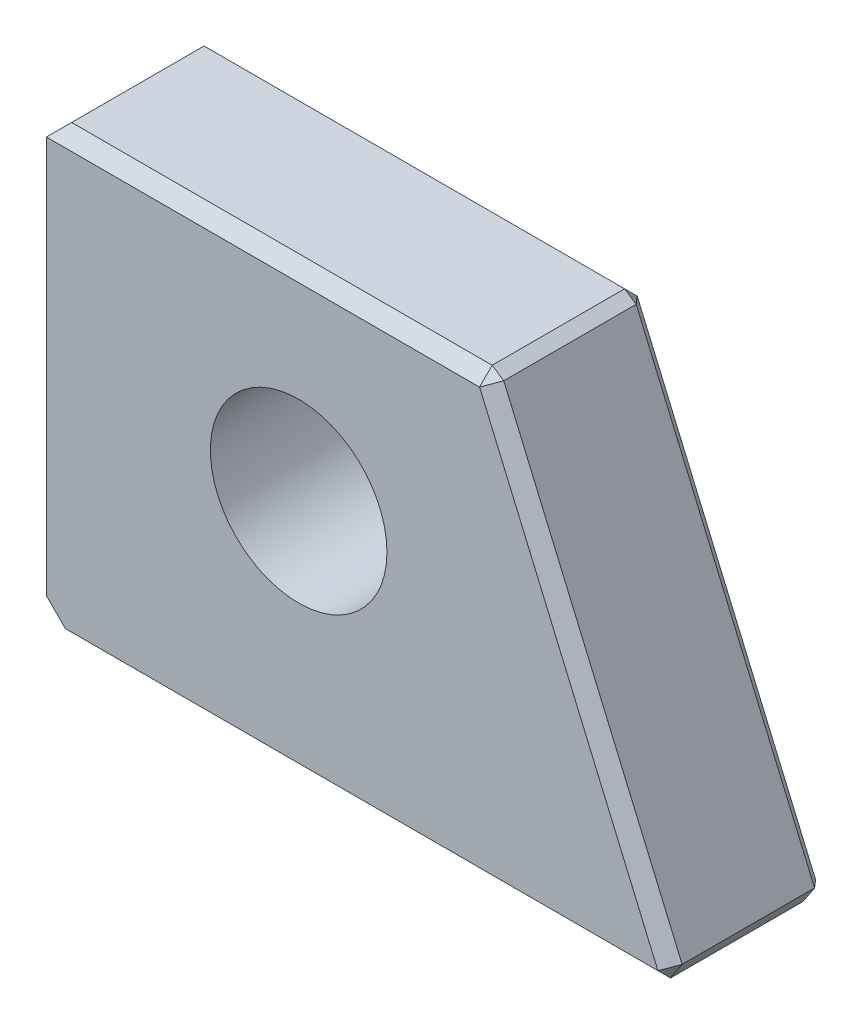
ISO-10303-21;
HEADER;
FILE_DESCRIPTION(('STEP AP214'),'2;1');
FILE_NAME('part.step','',(''),(''),'','','');
FILE_SCHEMA(('AUTOMOTIVE_DESIGN { 1 0 10303 214 1 1 1 1 }'));
ENDSEC;
DATA;
#1=APPLICATION_CONTEXT('core data for automotive mechanical design processes');
#2=APPLICATION_PROTOCOL_DEFINITION('international standard','automotive_design',2000,#1);
#3=PRODUCT_CONTEXT('',#1,'mechanical');
#4=PRODUCT('Part','Part','',(#3));
#5=PRODUCT_RELATED_PRODUCT_CATEGORY('part','',(#4));
#6=PRODUCT_DEFINITION_FORMATION('','',#4);
#7=PRODUCT_DEFINITION_CONTEXT('part definition',#1,'design');
#8=PRODUCT_DEFINITION('design','',#6,#7);
#9=PRODUCT_DEFINITION_SHAPE('','',#8);
#10=(LENGTH_UNIT() NAMED_UNIT(*) SI_UNIT(.MILLI.,.METRE.));
#11=(NAMED_UNIT(*) PLANE_ANGLE_UNIT() SI_UNIT($,.RADIAN.));
#12=(NAMED_UNIT(*) SI_UNIT($,.STERADIAN.) SOLID_ANGLE_UNIT());
#13=UNCERTAINTY_MEASURE_WITH_UNIT(LENGTH_MEASURE(1.E-05),#10,'distance_accuracy_value','');
#14=(GEOMETRIC_REPRESENTATION_CONTEXT(3) GLOBAL_UNCERTAINTY_ASSIGNED_CONTEXT((#13)) GLOBAL_UNIT_ASSIGNED_CONTEXT((#10,
#11,#12)) REPRESENTATION_CONTEXT('',''));
#15=CARTESIAN_POINT('',(0.,0.,0.));
#16=DIRECTION('',(0.,0.,1.));
#17=DIRECTION('',(1.,0.,0.));
#18=AXIS2_PLACEMENT_3D('',#15,#16,#17);
#19=CARTESIAN_POINT('',(89.9999999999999,78.754446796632,25.0000000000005));
#20=DIRECTION('',(0.,0.,-1.));
#21=DIRECTION('',(-1.,0.,0.));
#22=AXIS2_PLACEMENT_3D('',#19,#20,#21);
#23=PLANE('',#22);
#24=DIRECTION('',(0.707106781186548,-0.707106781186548,0.));
#25=VECTOR('',#24,1.);
#26=CARTESIAN_POINT('',(20.0000000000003,13.7544467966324,25.0000000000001));
#27=LINE('',#26,#25);
#28=CARTESIAN_POINT('',(20.0000000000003,13.7544467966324,25.0000000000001));
#29=VERTEX_POINT('',#28);
#30=CARTESIAN_POINT('',(22.9999999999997,10.7544467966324,25.0000000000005));
#31=VERTEX_POINT('',#30);
#32=EDGE_CURVE('E184',#29,#31,#27,.T.);
#33=ORIENTED_EDGE('',*,*,#32,.T.);
#34=DIRECTION('',(1.,0.,0.));
#35=VECTOR('',#34,1.);
#36=CARTESIAN_POINT('',(89.9999999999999,10.7544467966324,25.0000000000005));
#37=LINE('',#36,#35);
#38=CARTESIAN_POINT('',(116.966921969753,10.7544467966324,25.0000000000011));
#39=VERTEX_POINT('',#38);
#40=EDGE_CURVE('E212',#31,#39,#37,.T.);
#41=ORIENTED_EDGE('',*,*,#40,.T.);
#42=DIRECTION('',(-0.393919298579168,0.919145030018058,0.));
#43=VECTOR('',#42,1.);
#44=CARTESIAN_POINT('',(88.1617099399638,77.9666081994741,25.0000000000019));
#45=LINE('',#44,#43);
#46=CARTESIAN_POINT('',(88.6812076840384,76.7544467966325,25.0000000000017));
#47=VERTEX_POINT('',#46);
#48=EDGE_CURVE('E210',#39,#47,#45,.T.);
#49=ORIENTED_EDGE('',*,*,#48,.T.);
#50=DIRECTION('',(-1.,0.,0.));
#51=VECTOR('',#50,1.);
#52=CARTESIAN_POINT('',(89.9999999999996,76.7544467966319,25.0000000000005));
#53=LINE('',#52,#51);
#54=CARTESIAN_POINT('',(19.9999999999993,76.7544467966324,25.0000000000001));
#55=VERTEX_POINT('',#54);
#56=EDGE_CURVE('E208',#47,#55,#53,.T.);
#57=ORIENTED_EDGE('',*,*,#56,.T.);
#58=DIRECTION('',(0.,-1.,0.));
#59=VECTOR('',#58,1.);
#60=CARTESIAN_POINT('',(20.0000000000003,13.7544467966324,25.0000000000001));
#61=LINE('',#60,#59);
#62=EDGE_CURVE('E182',#55,#29,#61,.T.);
#63=ORIENTED_EDGE('',*,*,#62,.T.);
#64=EDGE_LOOP('',(#33,#41,#49,#57,#63));
#65=FACE_BOUND('',#64,.T.);
#66=CARTESIAN_POINT('',(60.0000000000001,46.7544467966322,25.0000000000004));
#67=DIRECTION('',(0.,0.,1.));
#68=DIRECTION('',(1.,0.,0.));
#69=AXIS2_PLACEMENT_3D('',#66,#67,#68);
#70=CIRCLE('',#69,14.);
#71=CARTESIAN_POINT('',(74.0000000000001,46.7544467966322,25.0000000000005));
#72=VERTEX_POINT('',#71);
#73=EDGE_CURVE('E174',#72,#72,#70,.T.);
#74=ORIENTED_EDGE('',*,*,#73,.F.);
#75=EDGE_LOOP('',(#74));
#76=FACE_BOUND('',#75,.T.);
#77=ADVANCED_FACE('F36',(#65,#76),#23,.F.);
#78=CARTESIAN_POINT('',(89.9999999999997,78.754446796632,4.44089209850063E-13));
#79=DIRECTION('',(0.,0.,-1.));
#80=DIRECTION('',(-1.,0.,0.));
#81=AXIS2_PLACEMENT_3D('',#78,#79,#80);
#82=PLANE('',#81);
#83=DIRECTION('',(0.,-1.,0.));
#84=VECTOR('',#83,1.);
#85=CARTESIAN_POINT('',(20.,13.7544467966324,0.));
#86=LINE('',#85,#84);
#87=CARTESIAN_POINT('',(20.,76.7544467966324,0.));
#88=VERTEX_POINT('',#87);
#89=CARTESIAN_POINT('',(20.,13.7544467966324,0.));
#90=VERTEX_POINT('',#89);
#91=EDGE_CURVE('E177',#88,#90,#86,.T.);
#92=ORIENTED_EDGE('',*,*,#91,.F.);
#93=DIRECTION('',(1.,0.,0.));
#94=VECTOR('',#93,1.);
#95=CARTESIAN_POINT('',(89.9999999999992,76.754446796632,4.44089209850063E-13));
#96=LINE('',#95,#94);
#97=CARTESIAN_POINT('',(88.6812076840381,76.7544467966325,1.88737914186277E-12));
#98=VERTEX_POINT('',#97);
#99=EDGE_CURVE('E206',#88,#98,#96,.T.);
#100=ORIENTED_EDGE('',*,*,#99,.T.);
#101=DIRECTION('',(0.393919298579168,-0.919145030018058,0.));
#102=VECTOR('',#101,1.);
#103=CARTESIAN_POINT('',(118.161709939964,7.96660819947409,2.27595720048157E-12));
#104=LINE('',#103,#102);
#105=CARTESIAN_POINT('',(116.966921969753,10.7544467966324,1.05818132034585E-12));
#106=VERTEX_POINT('',#105);
#107=EDGE_CURVE('E203',#98,#106,#104,.T.);
#108=ORIENTED_EDGE('',*,*,#107,.T.);
#109=DIRECTION('',(-1.,0.,0.));
#110=VECTOR('',#109,1.);
#111=CARTESIAN_POINT('',(24.9999999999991,10.7544467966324,4.44089209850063E-13));
#112=LINE('',#111,#110);
#113=CARTESIAN_POINT('',(22.999999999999,10.7544467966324,5.03069808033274E-13));
#114=VERTEX_POINT('',#113);
#115=EDGE_CURVE('E201',#106,#114,#112,.T.);
#116=ORIENTED_EDGE('',*,*,#115,.T.);
#117=DIRECTION('',(0.707106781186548,-0.707106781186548,0.));
#118=VECTOR('',#117,1.);
#119=CARTESIAN_POINT('',(20.,13.7544467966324,0.));
#120=LINE('',#119,#118);
#121=EDGE_CURVE('E179',#90,#114,#120,.T.);
#122=ORIENTED_EDGE('',*,*,#121,.F.);
#123=EDGE_LOOP('',(#92,#100,#108,#116,#122));
#124=FACE_BOUND('',#123,.T.);
#125=CARTESIAN_POINT('',(60.0000000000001,46.7544467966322,3.88578058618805E-13));
#126=DIRECTION('',(0.,0.,1.));
#127=DIRECTION('',(1.,0.,0.));
#128=AXIS2_PLACEMENT_3D('',#125,#126,#127);
#129=CIRCLE('',#128,14.);
#130=CARTESIAN_POINT('',(74.0000000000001,46.7544467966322,4.70956607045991E-13));
#131=VERTEX_POINT('',#130);
#132=EDGE_CURVE('E171',#131,#131,#129,.T.);
#133=ORIENTED_EDGE('',*,*,#132,.T.);
#134=EDGE_LOOP('',(#133));
#135=FACE_BOUND('',#134,.T.);
#136=ADVANCED_FACE('F267',(#124,#135),#82,.T.);
#137=CARTESIAN_POINT('',(119.999999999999,8.75444679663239,25.0000000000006));
#138=DIRECTION('',(-0.919145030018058,-0.393919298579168,0.));
#139=DIRECTION('',(0.393919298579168,-0.919145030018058,0.));
#140=AXIS2_PLACEMENT_3D('',#137,#138,#139);
#141=PLANE('',#140);
#142=DIRECTION('',(-0.393919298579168,0.919145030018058,0.));
#143=VECTOR('',#142,1.);
#144=CARTESIAN_POINT('',(89.9999999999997,78.754446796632,2.0000000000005));
#145=LINE('',#144,#143);
#146=CARTESIAN_POINT('',(118.805212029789,11.5422853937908,2.00000000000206));
#147=VERTEX_POINT('',#146);
#148=CARTESIAN_POINT('',(90.5194977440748,77.5422853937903,2.00000000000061));
#149=VERTEX_POINT('',#148);
#150=EDGE_CURVE('E196',#147,#149,#145,.T.);
#151=ORIENTED_EDGE('',*,*,#150,.T.);
#152=DIRECTION('',(0.,0.,1.));
#153=VECTOR('',#152,1.);
#154=CARTESIAN_POINT('',(90.5194977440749,77.5422853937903,25.0000000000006));
#155=LINE('',#154,#153);
#156=CARTESIAN_POINT('',(90.5194977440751,77.5422853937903,23.0000000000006));
#157=VERTEX_POINT('',#156);
#158=EDGE_CURVE('E199',#149,#157,#155,.T.);
#159=ORIENTED_EDGE('',*,*,#158,.T.);
#160=DIRECTION('',(0.393919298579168,-0.919145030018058,0.));
#161=VECTOR('',#160,1.);
#162=CARTESIAN_POINT('',(120.,8.75444679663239,23.0000000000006));
#163=LINE('',#162,#161);
#164=CARTESIAN_POINT('',(118.805212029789,11.5422853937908,23.000000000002));
#165=VERTEX_POINT('',#164);
#166=EDGE_CURVE('E194',#157,#165,#163,.T.);
#167=ORIENTED_EDGE('',*,*,#166,.T.);
#168=DIRECTION('',(0.,0.,-1.));
#169=VECTOR('',#168,1.);
#170=CARTESIAN_POINT('',(118.805212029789,11.5422853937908,25.000000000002));
#171=LINE('',#170,#169);
#172=EDGE_CURVE('E192',#165,#147,#171,.T.);
#173=ORIENTED_EDGE('',*,*,#172,.T.);
#174=EDGE_LOOP('',(#151,#159,#167,#173));
#175=FACE_BOUND('',#174,.T.);
#176=ADVANCED_FACE('F38',(#175),#141,.F.);
#177=CARTESIAN_POINT('',(19.9999999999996,78.7544467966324,25.0000000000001));
#178=DIRECTION('',(0.,-1.,0.));
#179=DIRECTION('',(0.,0.,-1.));
#180=AXIS2_PLACEMENT_3D('',#177,#178,#179);
#181=PLANE('',#180);
#182=DIRECTION('',(0.,0.,1.));
#183=VECTOR('',#182,1.);
#184=CARTESIAN_POINT('',(21.9999999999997,78.7544467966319,25.));
#185=LINE('',#184,#183);
#186=CARTESIAN_POINT('',(22.0000000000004,78.7544467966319,2.00000000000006));
#187=VERTEX_POINT('',#186);
#188=CARTESIAN_POINT('',(21.9999999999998,78.7544467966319,23.));
#189=VERTEX_POINT('',#188);
#190=EDGE_CURVE('E220',#187,#189,#185,.T.);
#191=ORIENTED_EDGE('',*,*,#190,.T.);
#192=DIRECTION('',(1.,0.,0.));
#193=VECTOR('',#192,1.);
#194=CARTESIAN_POINT('',(19.9999999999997,78.7544467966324,23.));
#195=LINE('',#194,#193);
#196=CARTESIAN_POINT('',(88.6812076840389,78.7544467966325,23.0000000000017));
#197=VERTEX_POINT('',#196);
#198=EDGE_CURVE('E223',#189,#197,#195,.T.);
#199=ORIENTED_EDGE('',*,*,#198,.T.);
#200=DIRECTION('',(0.,0.,-1.));
#201=VECTOR('',#200,1.);
#202=CARTESIAN_POINT('',(88.6812076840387,78.7544467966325,25.0000000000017));
#203=LINE('',#202,#201);
#204=CARTESIAN_POINT('',(88.6812076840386,78.7544467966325,2.00000000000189));
#205=VERTEX_POINT('',#204);
#206=EDGE_CURVE('E218',#197,#205,#203,.T.);
#207=ORIENTED_EDGE('',*,*,#206,.T.);
#208=DIRECTION('',(-1.,0.,0.));
#209=VECTOR('',#208,1.);
#210=CARTESIAN_POINT('',(20.0000000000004,78.7544467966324,2.00000000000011));
#211=LINE('',#210,#209);
#212=EDGE_CURVE('E216',#205,#187,#211,.T.);
#213=ORIENTED_EDGE('',*,*,#212,.T.);
#214=EDGE_LOOP('',(#191,#199,#207,#213));
#215=FACE_BOUND('',#214,.T.);
#216=ADVANCED_FACE('F301',(#215),#181,.F.);
#217=CARTESIAN_POINT('',(20.0000000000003,13.7544467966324,25.0000000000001));
#218=DIRECTION('',(1.,0.,0.));
#219=DIRECTION('',(0.,0.,-1.));
#220=AXIS2_PLACEMENT_3D('',#217,#218,#219);
#221=PLANE('',#220);
#222=ORIENTED_EDGE('',*,*,#62,.F.);
#223=DIRECTION('',(0.,0.,-1.));
#224=VECTOR('',#223,1.);
#225=CARTESIAN_POINT('',(19.9999999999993,76.7544467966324,25.0000000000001));
#226=LINE('',#225,#224);
#227=EDGE_CURVE('E214',#55,#88,#226,.T.);
#228=ORIENTED_EDGE('',*,*,#227,.T.);
#229=ORIENTED_EDGE('',*,*,#91,.T.);
#230=DIRECTION('',(0.,0.,-1.));
#231=VECTOR('',#230,1.);
#232=CARTESIAN_POINT('',(20.0000000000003,13.7544467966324,25.0000000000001));
#233=LINE('',#232,#231);
#234=EDGE_CURVE('E189',#29,#90,#233,.T.);
#235=ORIENTED_EDGE('',*,*,#234,.F.);
#236=EDGE_LOOP('',(#222,#228,#229,#235));
#237=FACE_BOUND('',#236,.T.);
#238=ADVANCED_FACE('F264',(#237),#221,.F.);
#239=CARTESIAN_POINT('',(20.0000000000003,13.7544467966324,25.0000000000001));
#240=DIRECTION('',(0.707106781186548,0.707106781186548,0.));
#241=DIRECTION('',(-0.707106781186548,0.707106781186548,0.));
#242=AXIS2_PLACEMENT_3D('',#239,#240,#241);
#243=PLANE('',#242);
#244=DIRECTION('',(0.,0.,-1.));
#245=VECTOR('',#244,1.);
#246=CARTESIAN_POINT('',(25.0000000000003,8.75444679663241,25.0000000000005));
#247=LINE('',#246,#245);
#248=CARTESIAN_POINT('',(25.0000000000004,8.75444679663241,23.0000000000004));
#249=VERTEX_POINT('',#248);
#250=CARTESIAN_POINT('',(25.0000000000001,8.75444679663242,2.00000000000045));
#251=VERTEX_POINT('',#250);
#252=EDGE_CURVE('E187',#249,#251,#247,.T.);
#253=ORIENTED_EDGE('',*,*,#252,.F.);
#254=DIRECTION('',(0.577350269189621,-0.577350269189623,-0.577350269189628));
#255=VECTOR('',#254,1.);
#256=CARTESIAN_POINT('',(45.3333333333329,-11.5788865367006,2.66666666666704));
#257=LINE('',#256,#255);
#258=EDGE_CURVE('E11',#249,#31,#257,.F.);
#259=ORIENTED_EDGE('',*,*,#258,.T.);
#260=ORIENTED_EDGE('',*,*,#32,.F.);
#261=ORIENTED_EDGE('',*,*,#234,.T.);
#262=ORIENTED_EDGE('',*,*,#121,.T.);
#263=DIRECTION('',(0.577350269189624,-0.577350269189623,0.577350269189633));
#264=VECTOR('',#263,1.);
#265=CARTESIAN_POINT('',(25.0000000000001,8.75444679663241,2.0000000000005));
#266=LINE('',#265,#264);
#267=EDGE_CURVE('E44',#114,#251,#266,.T.);
#268=ORIENTED_EDGE('',*,*,#267,.T.);
#269=EDGE_LOOP('',(#253,#259,#260,#261,#262,#268));
#270=FACE_BOUND('',#269,.T.);
#271=ADVANCED_FACE('F231',(#270),#243,.F.);
#272=CARTESIAN_POINT('',(25.0000000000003,8.75444679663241,25.0000000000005));
#273=DIRECTION('',(0.,1.,0.));
#274=DIRECTION('',(0.,0.,1.));
#275=AXIS2_PLACEMENT_3D('',#272,#273,#274);
#276=PLANE('',#275);
#277=CARTESIAN_POINT('',(32.0000000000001,8.75444679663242,12.5000000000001));
#278=DIRECTION('',(0.,-1.,0.));
#279=DIRECTION('',(0.,0.,-1.));
#280=AXIS2_PLACEMENT_3D('',#277,#278,#279);
#281=CIRCLE('',#280,3.4);
#282=CARTESIAN_POINT('',(32.0000000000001,8.75444679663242,9.10000000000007));
#283=VERTEX_POINT('',#282);
#284=EDGE_CURVE('E127',#283,#283,#281,.T.);
#285=ORIENTED_EDGE('',*,*,#284,.F.);
#286=EDGE_LOOP('',(#285));
#287=FACE_BOUND('',#286,.T.);
#288=DIRECTION('',(0.,0.,1.));
#289=VECTOR('',#288,1.);
#290=CARTESIAN_POINT('',(116.966921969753,8.75444679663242,25.0000000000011));
#291=LINE('',#290,#289);
#292=CARTESIAN_POINT('',(116.966921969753,8.75444679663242,2.00000000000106));
#293=VERTEX_POINT('',#292);
#294=CARTESIAN_POINT('',(116.966921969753,8.75444679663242,23.000000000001));
#295=VERTEX_POINT('',#294);
#296=EDGE_CURVE('E51',#293,#295,#291,.T.);
#297=ORIENTED_EDGE('',*,*,#296,.T.);
#298=DIRECTION('',(-1.,0.,0.));
#299=VECTOR('',#298,1.);
#300=CARTESIAN_POINT('',(25.0000000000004,8.75444679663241,23.0000000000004));
#301=LINE('',#300,#299);
#302=EDGE_CURVE('E227',#295,#249,#301,.T.);
#303=ORIENTED_EDGE('',*,*,#302,.T.);
#304=ORIENTED_EDGE('',*,*,#252,.T.);
#305=DIRECTION('',(1.,0.,0.));
#306=VECTOR('',#305,1.);
#307=CARTESIAN_POINT('',(120.,8.75444679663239,2.00000000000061));
#308=LINE('',#307,#306);
#309=EDGE_CURVE('E56',#251,#293,#308,.T.);
#310=ORIENTED_EDGE('',*,*,#309,.T.);
#311=EDGE_LOOP('',(#297,#303,#304,#310));
#312=FACE_BOUND('',#311,.T.);
#313=ADVANCED_FACE('F236',(#287,#312),#276,.F.);
#314=CARTESIAN_POINT('',(60.0000000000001,46.7544467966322,25.0000000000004));
#315=DIRECTION('',(0.,0.,-1.));
#316=DIRECTION('',(-1.,0.,0.));
#317=AXIS2_PLACEMENT_3D('',#314,#315,#316);
#318=CYLINDRICAL_SURFACE('',#317,14.);
#319=ORIENTED_EDGE('',*,*,#73,.T.);
#320=EDGE_LOOP('',(#319));
#321=FACE_BOUND('',#320,.T.);
#322=ORIENTED_EDGE('',*,*,#132,.F.);
#323=EDGE_LOOP('',(#322));
#324=FACE_BOUND('',#323,.T.);
#325=ADVANCED_FACE('F318',(#321,#324),#318,.F.);
#326=CARTESIAN_POINT('',(89.9999999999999,10.7544467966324,25.0000000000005));
#327=DIRECTION('',(0.,0.707106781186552,-0.707106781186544));
#328=DIRECTION('',(0.,0.707106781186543,0.707106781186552));
#329=AXIS2_PLACEMENT_3D('',#326,#327,#328);
#330=PLANE('',#329);
#331=ORIENTED_EDGE('',*,*,#258,.F.);
#332=ORIENTED_EDGE('',*,*,#302,.F.);
#333=DIRECTION('',(0.,0.707106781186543,0.707106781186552));
#334=VECTOR('',#333,1.);
#335=CARTESIAN_POINT('',(116.966921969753,10.1483660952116,24.3939192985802));
#336=LINE('',#335,#334);
#337=EDGE_CURVE('E168',#39,#295,#336,.F.);
#338=ORIENTED_EDGE('',*,*,#337,.F.);
#339=ORIENTED_EDGE('',*,*,#40,.F.);
#340=EDGE_LOOP('',(#331,#332,#338,#339));
#341=FACE_BOUND('',#340,.T.);
#342=ADVANCED_FACE('F254',(#341),#330,.F.);
#343=CARTESIAN_POINT('',(88.1617099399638,77.9666081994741,25.0000000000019));
#344=DIRECTION('',(-0.649933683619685,-0.278543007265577,-0.707106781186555));
#345=DIRECTION('',(-0.736244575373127,0.,0.676715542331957));
#346=AXIS2_PLACEMENT_3D('',#343,#344,#345);
#347=PLANE('',#346);
#348=DIRECTION('',(-0.649933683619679,-0.278543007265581,0.70710678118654));
#349=VECTOR('',#348,1.);
#350=CARTESIAN_POINT('',(88.6812076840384,76.7544467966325,25.0000000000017));
#351=LINE('',#350,#349);
#352=EDGE_CURVE('E162',#47,#157,#351,.F.);
#353=ORIENTED_EDGE('',*,*,#352,.F.);
#354=ORIENTED_EDGE('',*,*,#48,.F.);
#355=DIRECTION('',(0.649933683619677,0.278543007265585,-0.70710678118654));
#356=VECTOR('',#355,1.);
#357=CARTESIAN_POINT('',(118.805212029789,11.5422853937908,23.000000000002));
#358=LINE('',#357,#356);
#359=EDGE_CURVE('E165',#165,#39,#358,.F.);
#360=ORIENTED_EDGE('',*,*,#359,.F.);
#361=ORIENTED_EDGE('',*,*,#166,.F.);
#362=EDGE_LOOP('',(#353,#354,#360,#361));
#363=FACE_BOUND('',#362,.T.);
#364=ADVANCED_FACE('F288',(#363),#347,.F.);
#365=CARTESIAN_POINT('',(89.9999999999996,76.7544467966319,25.0000000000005));
#366=DIRECTION('',(0.,-0.707106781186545,-0.70710678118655));
#367=DIRECTION('',(0.,0.70710678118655,-0.707106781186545));
#368=AXIS2_PLACEMENT_3D('',#365,#366,#367);
#369=PLANE('',#368);
#370=DIRECTION('',(-0.577350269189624,-0.577350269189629,0.577350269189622));
#371=VECTOR('',#370,1.);
#372=CARTESIAN_POINT('',(43.3333333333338,100.087780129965,1.66666666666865));
#373=LINE('',#372,#371);
#374=EDGE_CURVE('E157',#55,#189,#373,.F.);
#375=ORIENTED_EDGE('',*,*,#374,.F.);
#376=ORIENTED_EDGE('',*,*,#56,.F.);
#377=DIRECTION('',(0.,0.70710678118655,-0.707106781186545));
#378=VECTOR('',#377,1.);
#379=CARTESIAN_POINT('',(88.6812076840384,76.7544467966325,25.0000000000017));
#380=LINE('',#379,#378);
#381=EDGE_CURVE('E159',#197,#47,#380,.F.);
#382=ORIENTED_EDGE('',*,*,#381,.F.);
#383=ORIENTED_EDGE('',*,*,#198,.F.);
#384=EDGE_LOOP('',(#375,#376,#382,#383));
#385=FACE_BOUND('',#384,.T.);
#386=ADVANCED_FACE('F291',(#385),#369,.F.);
#387=CARTESIAN_POINT('',(118.805212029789,11.5422853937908,23.000000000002));
#388=DIRECTION('',(0.731349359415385,-0.482248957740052,0.482248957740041));
#389=DIRECTION('',(0.550491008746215,0.834841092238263,0.));
#390=AXIS2_PLACEMENT_3D('',#387,#388,#389);
#391=PLANE('',#390);
#392=ORIENTED_EDGE('',*,*,#359,.T.);
#393=ORIENTED_EDGE('',*,*,#337,.T.);
#394=DIRECTION('',(-0.550491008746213,-0.834841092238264,0.));
#395=VECTOR('',#394,1.);
#396=CARTESIAN_POINT('',(118.805212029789,11.5422853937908,23.000000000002));
#397=LINE('',#396,#395);
#398=EDGE_CURVE('E154',#165,#295,#397,.T.);
#399=ORIENTED_EDGE('',*,*,#398,.F.);
#400=EDGE_LOOP('',(#392,#393,#399));
#401=FACE_BOUND('',#400,.T.);
#402=ADVANCED_FACE('F249',(#401),#391,.T.);
#403=CARTESIAN_POINT('',(88.6812076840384,76.7544467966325,25.0000000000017));
#404=DIRECTION('',(0.422585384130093,0.640867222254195,0.640867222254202));
#405=DIRECTION('',(0.,-0.707106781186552,0.707106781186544));
#406=AXIS2_PLACEMENT_3D('',#403,#404,#405);
#407=PLANE('',#406);
#408=ORIENTED_EDGE('',*,*,#381,.T.);
#409=ORIENTED_EDGE('',*,*,#352,.T.);
#410=DIRECTION('',(0.834841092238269,-0.550491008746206,0.));
#411=VECTOR('',#410,1.);
#412=CARTESIAN_POINT('',(89.600352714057,78.1483660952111,23.0000000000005));
#413=LINE('',#412,#411);
#414=EDGE_CURVE('E151',#197,#157,#413,.T.);
#415=ORIENTED_EDGE('',*,*,#414,.F.);
#416=EDGE_LOOP('',(#408,#409,#415));
#417=FACE_BOUND('',#416,.T.);
#418=ADVANCED_FACE('F361',(#417),#407,.T.);
#419=CARTESIAN_POINT('',(19.9999999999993,76.7544467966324,25.0000000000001));
#420=DIRECTION('',(0.70710678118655,-0.707106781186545,0.));
#421=DIRECTION('',(0.707106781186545,0.70710678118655,0.));
#422=AXIS2_PLACEMENT_3D('',#419,#420,#421);
#423=PLANE('',#422);
#424=ORIENTED_EDGE('',*,*,#374,.T.);
#425=ORIENTED_EDGE('',*,*,#190,.F.);
#426=DIRECTION('',(-0.577350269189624,-0.577350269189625,-0.577350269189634));
#427=VECTOR('',#426,1.);
#428=CARTESIAN_POINT('',(21.3333333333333,78.0877801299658,1.33333333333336));
#429=LINE('',#428,#427);
#430=EDGE_CURVE('E148',#88,#187,#429,.F.);
#431=ORIENTED_EDGE('',*,*,#430,.F.);
#432=ORIENTED_EDGE('',*,*,#227,.F.);
#433=EDGE_LOOP('',(#424,#425,#431,#432));
#434=FACE_BOUND('',#433,.T.);
#435=ADVANCED_FACE('F296',(#434),#423,.F.);
#436=CARTESIAN_POINT('',(25.0000000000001,8.75444679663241,2.0000000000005));
#437=DIRECTION('',(0.,-0.707106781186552,-0.707106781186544));
#438=DIRECTION('',(0.,0.707106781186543,-0.707106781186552));
#439=AXIS2_PLACEMENT_3D('',#436,#437,#438);
#440=PLANE('',#439);
#441=ORIENTED_EDGE('',*,*,#267,.F.);
#442=ORIENTED_EDGE('',*,*,#115,.F.);
#443=DIRECTION('',(0.,0.707106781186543,-0.707106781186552));
#444=VECTOR('',#443,1.);
#445=CARTESIAN_POINT('',(116.966921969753,10.7544467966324,1.05818132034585E-12));
#446=LINE('',#445,#444);
#447=EDGE_CURVE('E145',#293,#106,#446,.T.);
#448=ORIENTED_EDGE('',*,*,#447,.F.);
#449=ORIENTED_EDGE('',*,*,#309,.F.);
#450=EDGE_LOOP('',(#441,#442,#448,#449));
#451=FACE_BOUND('',#450,.T.);
#452=ADVANCED_FACE('F238',(#451),#440,.T.);
#453=CARTESIAN_POINT('',(118.805212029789,11.5422853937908,25.000000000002));
#454=DIRECTION('',(-0.834841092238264,0.550491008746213,0.));
#455=DIRECTION('',(-0.550491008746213,-0.834841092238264,0.));
#456=AXIS2_PLACEMENT_3D('',#453,#454,#455);
#457=PLANE('',#456);
#458=ORIENTED_EDGE('',*,*,#398,.T.);
#459=ORIENTED_EDGE('',*,*,#296,.F.);
#460=DIRECTION('',(0.550491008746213,0.834841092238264,0.));
#461=VECTOR('',#460,1.);
#462=CARTESIAN_POINT('',(117.886066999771,10.1483660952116,2.00000000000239));
#463=LINE('',#462,#461);
#464=EDGE_CURVE('E142',#147,#293,#463,.F.);
#465=ORIENTED_EDGE('',*,*,#464,.F.);
#466=ORIENTED_EDGE('',*,*,#172,.F.);
#467=EDGE_LOOP('',(#458,#459,#465,#466));
#468=FACE_BOUND('',#467,.T.);
#469=ADVANCED_FACE('F246',(#468),#457,.F.);
#470=CARTESIAN_POINT('',(88.6812076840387,78.7544467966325,25.0000000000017));
#471=DIRECTION('',(-0.550491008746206,-0.834841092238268,0.));
#472=DIRECTION('',(0.834841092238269,-0.550491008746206,0.));
#473=AXIS2_PLACEMENT_3D('',#470,#471,#472);
#474=PLANE('',#473);
#475=ORIENTED_EDGE('',*,*,#414,.T.);
#476=ORIENTED_EDGE('',*,*,#158,.F.);
#477=DIRECTION('',(-0.834841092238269,0.550491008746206,0.));
#478=VECTOR('',#477,1.);
#479=CARTESIAN_POINT('',(90.5194977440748,77.5422853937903,2.00000000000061));
#480=LINE('',#479,#478);
#481=EDGE_CURVE('E139',#205,#149,#480,.F.);
#482=ORIENTED_EDGE('',*,*,#481,.F.);
#483=ORIENTED_EDGE('',*,*,#206,.F.);
#484=EDGE_LOOP('',(#475,#476,#482,#483));
#485=FACE_BOUND('',#484,.T.);
#486=ADVANCED_FACE('F282',(#485),#474,.F.);
#487=CARTESIAN_POINT('',(20.0000000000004,78.7544467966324,2.00000000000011));
#488=DIRECTION('',(0.,0.707106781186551,-0.707106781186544));
#489=DIRECTION('',(0.,0.707106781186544,0.707106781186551));
#490=AXIS2_PLACEMENT_3D('',#487,#488,#489);
#491=PLANE('',#490);
#492=ORIENTED_EDGE('',*,*,#430,.T.);
#493=ORIENTED_EDGE('',*,*,#212,.F.);
#494=DIRECTION('',(0.,0.707106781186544,0.707106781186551));
#495=VECTOR('',#494,1.);
#496=CARTESIAN_POINT('',(88.681207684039,78.1483660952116,1.39391929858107));
#497=LINE('',#496,#495);
#498=EDGE_CURVE('E136',#98,#205,#497,.T.);
#499=ORIENTED_EDGE('',*,*,#498,.F.);
#500=ORIENTED_EDGE('',*,*,#99,.F.);
#501=EDGE_LOOP('',(#492,#493,#499,#500));
#502=FACE_BOUND('',#501,.T.);
#503=ADVANCED_FACE('F299',(#502),#491,.T.);
#504=CARTESIAN_POINT('',(116.966921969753,10.7544467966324,1.05818132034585E-12));
#505=DIRECTION('',(0.731349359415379,-0.482248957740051,-0.482248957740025));
#506=DIRECTION('',(0.550491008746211,0.834841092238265,0.));
#507=AXIS2_PLACEMENT_3D('',#504,#505,#506);
#508=PLANE('',#507);
#509=ORIENTED_EDGE('',*,*,#464,.T.);
#510=ORIENTED_EDGE('',*,*,#447,.T.);
#511=DIRECTION('',(0.649933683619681,0.278543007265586,0.707106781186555));
#512=VECTOR('',#511,1.);
#513=CARTESIAN_POINT('',(116.966921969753,10.7544467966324,1.05818132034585E-12));
#514=LINE('',#513,#512);
#515=EDGE_CURVE('E134',#147,#106,#514,.F.);
#516=ORIENTED_EDGE('',*,*,#515,.F.);
#517=EDGE_LOOP('',(#509,#510,#516));
#518=FACE_BOUND('',#517,.T.);
#519=ADVANCED_FACE('F242',(#518),#508,.T.);
#520=CARTESIAN_POINT('',(90.5194977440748,77.5422853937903,2.00000000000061));
#521=DIRECTION('',(0.422585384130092,0.6408672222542,-0.640867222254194));
#522=DIRECTION('',(0.,0.707106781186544,0.707106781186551));
#523=AXIS2_PLACEMENT_3D('',#520,#521,#522);
#524=PLANE('',#523);
#525=ORIENTED_EDGE('',*,*,#498,.T.);
#526=ORIENTED_EDGE('',*,*,#481,.T.);
#527=DIRECTION('',(-0.649933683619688,-0.27854300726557,-0.707106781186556));
#528=VECTOR('',#527,1.);
#529=CARTESIAN_POINT('',(90.5194977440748,77.5422853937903,2.00000000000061));
#530=LINE('',#529,#528);
#531=EDGE_CURVE('E130',#98,#149,#530,.F.);
#532=ORIENTED_EDGE('',*,*,#531,.F.);
#533=EDGE_LOOP('',(#525,#526,#532));
#534=FACE_BOUND('',#533,.T.);
#535=ADVANCED_FACE('F277',(#534),#524,.T.);
#536=CARTESIAN_POINT('',(120.,8.75444679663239,2.00000000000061));
#537=DIRECTION('',(0.64993368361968,0.278543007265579,-0.70710678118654));
#538=DIRECTION('',(-0.736244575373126,0.,-0.676715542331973));
#539=AXIS2_PLACEMENT_3D('',#536,#537,#538);
#540=PLANE('',#539);
#541=ORIENTED_EDGE('',*,*,#515,.T.);
#542=ORIENTED_EDGE('',*,*,#107,.F.);
#543=ORIENTED_EDGE('',*,*,#531,.T.);
#544=ORIENTED_EDGE('',*,*,#150,.F.);
#545=EDGE_LOOP('',(#541,#542,#543,#544));
#546=FACE_BOUND('',#545,.T.);
#547=ADVANCED_FACE('F275',(#546),#540,.T.);
#548=CARTESIAN_POINT('',(32.0000000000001,8.75444679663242,12.5000000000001));
#549=DIRECTION('',(0.,-1.,0.));
#550=DIRECTION('',(0.,0.,-1.));
#551=AXIS2_PLACEMENT_3D('',#548,#549,#550);
#552=CYLINDRICAL_SURFACE('',#551,3.4);
#553=CARTESIAN_POINT('',(32.0000000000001,31.0044467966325,12.5000000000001));
#554=DIRECTION('',(0.,-1.,0.));
#555=DIRECTION('',(0.,0.,-1.));
#556=AXIS2_PLACEMENT_3D('',#553,#554,#555);
#557=CIRCLE('',#556,3.39999999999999);
#558=CARTESIAN_POINT('',(32.0000000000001,31.0044467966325,9.10000000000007));
#559=VERTEX_POINT('',#558);
#560=EDGE_CURVE('E125',#559,#559,#557,.T.);
#561=ORIENTED_EDGE('',*,*,#560,.F.);
#562=EDGE_LOOP('',(#561));
#563=FACE_BOUND('',#562,.T.);
#564=ORIENTED_EDGE('',*,*,#284,.T.);
#565=EDGE_LOOP('',(#564));
#566=FACE_BOUND('',#565,.T.);
#567=ADVANCED_FACE('F121',(#563,#566),#552,.F.);
#568=CARTESIAN_POINT('',(32.0000000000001,31.0044467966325,12.5000000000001));
#569=DIRECTION('',(0.,-1.,0.));
#570=DIRECTION('',(0.,0.,-1.));
#571=AXIS2_PLACEMENT_3D('',#568,#569,#570);
#572=CONICAL_SURFACE('',#571,3.39999999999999,1.02974425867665);
#573=CARTESIAN_POINT('',(32.0000000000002,33.0473729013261,12.5000000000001));
#574=VERTEX_POINT('',#573);
#575=VERTEX_LOOP('',#574);
#576=FACE_BOUND('',#575,.T.);
#577=ORIENTED_EDGE('',*,*,#560,.T.);
#578=EDGE_LOOP('',(#577));
#579=FACE_BOUND('',#578,.T.);
#580=ADVANCED_FACE('F118',(#576,#579),#572,.F.);
#581=CLOSED_SHELL('',(#77,#136,#176,#216,#238,#271,#313,#325,#342,#364,#386,#402,#418,#435,#452,
#469,#486,#503,#519,#535,#547,#567,#580));
#582=MANIFOLD_SOLID_BREP('B2',#581);
#583=ADVANCED_BREP_SHAPE_REPRESENTATION('',(#18,#582),#14);
#584=SHAPE_DEFINITION_REPRESENTATION(#9,#583);
ENDSEC;
END-ISO-10303-21;
